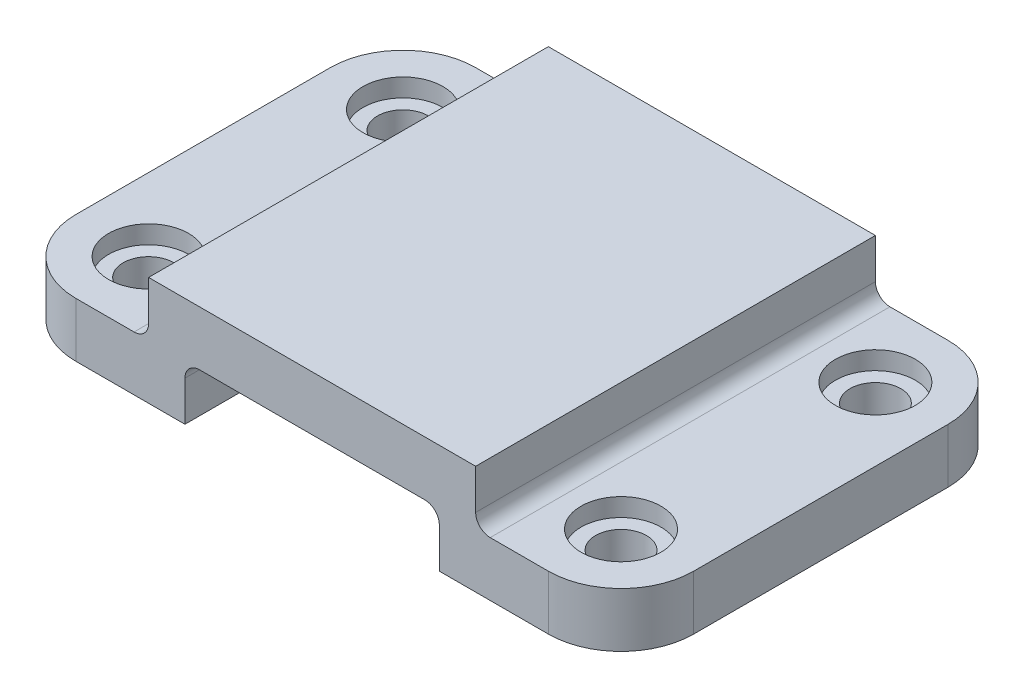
ISO-10303-21;
HEADER;
FILE_DESCRIPTION(('STEP AP214'),'2;1');
FILE_NAME('part.step','',(''),(''),'','','');
FILE_SCHEMA(('AUTOMOTIVE_DESIGN { 1 0 10303 214 1 1 1 1 }'));
ENDSEC;
DATA;
#1=APPLICATION_CONTEXT('core data for automotive mechanical design processes');
#2=APPLICATION_PROTOCOL_DEFINITION('international standard','automotive_design',2000,#1);
#3=PRODUCT_CONTEXT('',#1,'mechanical');
#4=PRODUCT('Part','Part','',(#3));
#5=PRODUCT_RELATED_PRODUCT_CATEGORY('part','',(#4));
#6=PRODUCT_DEFINITION_FORMATION('','',#4);
#7=PRODUCT_DEFINITION_CONTEXT('part definition',#1,'design');
#8=PRODUCT_DEFINITION('design','',#6,#7);
#9=PRODUCT_DEFINITION_SHAPE('','',#8);
#10=(LENGTH_UNIT() NAMED_UNIT(*) SI_UNIT(.MILLI.,.METRE.));
#11=(NAMED_UNIT(*) PLANE_ANGLE_UNIT() SI_UNIT($,.RADIAN.));
#12=(NAMED_UNIT(*) SI_UNIT($,.STERADIAN.) SOLID_ANGLE_UNIT());
#13=UNCERTAINTY_MEASURE_WITH_UNIT(LENGTH_MEASURE(1.E-05),#10,'distance_accuracy_value','');
#14=(GEOMETRIC_REPRESENTATION_CONTEXT(3) GLOBAL_UNCERTAINTY_ASSIGNED_CONTEXT((#13)) GLOBAL_UNIT_ASSIGNED_CONTEXT((#10,
#11,#12)) REPRESENTATION_CONTEXT('',''));
#15=CARTESIAN_POINT('',(0.,0.,0.));
#16=DIRECTION('',(0.,0.,1.));
#17=DIRECTION('',(1.,0.,0.));
#18=AXIS2_PLACEMENT_3D('',#15,#16,#17);
#19=CARTESIAN_POINT('',(82.55,-28.5750000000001,25.4));
#20=DIRECTION('',(0.,1.,0.));
#21=DIRECTION('',(-1.,0.,0.));
#22=AXIS2_PLACEMENT_3D('',#19,#20,#21);
#23=CYLINDRICAL_SURFACE('',#22,8.88999999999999);
#24=CARTESIAN_POINT('',(82.55,-28.5750000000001,25.4));
#25=DIRECTION('',(0.,1.,0.));
#26=DIRECTION('',(-1.,0.,0.));
#27=AXIS2_PLACEMENT_3D('',#24,#25,#26);
#28=CIRCLE('',#27,8.88999999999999);
#29=CARTESIAN_POINT('',(73.66,-28.5750000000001,25.4));
#30=VERTEX_POINT('',#29);
#31=EDGE_CURVE('E322',#30,#30,#28,.T.);
#32=CARTESIAN_POINT('',(82.55,-15.8750000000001,25.4));
#33=DIRECTION('',(0.,1.,0.));
#34=DIRECTION('',(-1.,0.,0.));
#35=AXIS2_PLACEMENT_3D('',#32,#33,#34);
#36=CIRCLE('',#35,8.88999999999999);
#37=CARTESIAN_POINT('',(73.66,-15.8750000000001,25.4));
#38=VERTEX_POINT('',#37);
#39=EDGE_CURVE('E321',#38,#38,#36,.F.);
#40=CARTESIAN_POINT('',(73.66,-28.5750000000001,25.4));
#41=CARTESIAN_POINT('',(73.66,-28.4427083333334,25.4));
#42=CARTESIAN_POINT('',(73.66,-28.3104166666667,25.4));
#43=CARTESIAN_POINT('',(73.66,-28.0458333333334,25.4));
#44=CARTESIAN_POINT('',(73.66,-27.9135416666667,25.4));
#45=CARTESIAN_POINT('',(73.66,-27.6489583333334,25.4));
#46=CARTESIAN_POINT('',(73.66,-27.5166666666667,25.4));
#47=CARTESIAN_POINT('',(73.66,-27.2520833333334,25.4));
#48=CARTESIAN_POINT('',(73.66,-27.1197916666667,25.4));
#49=CARTESIAN_POINT('',(73.66,-26.8552083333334,25.4));
#50=CARTESIAN_POINT('',(73.66,-26.7229166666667,25.4));
#51=CARTESIAN_POINT('',(73.66,-26.4583333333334,25.4));
#52=CARTESIAN_POINT('',(73.66,-26.3260416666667,25.4));
#53=CARTESIAN_POINT('',(73.66,-26.0614583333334,25.4));
#54=CARTESIAN_POINT('',(73.66,-25.9291666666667,25.4));
#55=CARTESIAN_POINT('',(73.66,-25.6645833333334,25.4));
#56=CARTESIAN_POINT('',(73.66,-25.5322916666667,25.4));
#57=CARTESIAN_POINT('',(73.66,-25.2677083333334,25.4));
#58=CARTESIAN_POINT('',(73.66,-25.1354166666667,25.4));
#59=CARTESIAN_POINT('',(73.66,-24.8708333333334,25.4));
#60=CARTESIAN_POINT('',(73.66,-24.7385416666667,25.4));
#61=CARTESIAN_POINT('',(73.66,-24.4739583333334,25.4));
#62=CARTESIAN_POINT('',(73.66,-24.3416666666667,25.4));
#63=CARTESIAN_POINT('',(73.66,-24.0770833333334,25.4));
#64=CARTESIAN_POINT('',(73.66,-23.9447916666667,25.4));
#65=CARTESIAN_POINT('',(73.66,-23.6802083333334,25.4));
#66=CARTESIAN_POINT('',(73.66,-23.5479166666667,25.4));
#67=CARTESIAN_POINT('',(73.66,-23.2833333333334,25.4));
#68=CARTESIAN_POINT('',(73.66,-23.1510416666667,25.4));
#69=CARTESIAN_POINT('',(73.66,-22.8864583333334,25.4));
#70=CARTESIAN_POINT('',(73.66,-22.7541666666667,25.4));
#71=CARTESIAN_POINT('',(73.66,-22.4895833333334,25.4));
#72=CARTESIAN_POINT('',(73.66,-22.3572916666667,25.4));
#73=CARTESIAN_POINT('',(73.66,-22.0927083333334,25.4));
#74=CARTESIAN_POINT('',(73.66,-21.9604166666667,25.4));
#75=CARTESIAN_POINT('',(73.66,-21.6958333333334,25.4));
#76=CARTESIAN_POINT('',(73.66,-21.5635416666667,25.4));
#77=CARTESIAN_POINT('',(73.66,-21.2989583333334,25.4));
#78=CARTESIAN_POINT('',(73.66,-21.1666666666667,25.4));
#79=CARTESIAN_POINT('',(73.66,-20.9020833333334,25.4));
#80=CARTESIAN_POINT('',(73.66,-20.7697916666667,25.4));
#81=CARTESIAN_POINT('',(73.66,-20.5052083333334,25.4));
#82=CARTESIAN_POINT('',(73.66,-20.3729166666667,25.4));
#83=CARTESIAN_POINT('',(73.66,-20.1083333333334,25.4));
#84=CARTESIAN_POINT('',(73.66,-19.9760416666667,25.4));
#85=CARTESIAN_POINT('',(73.66,-19.7114583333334,25.4));
#86=CARTESIAN_POINT('',(73.66,-19.5791666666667,25.4));
#87=CARTESIAN_POINT('',(73.66,-19.3145833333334,25.4));
#88=CARTESIAN_POINT('',(73.66,-19.1822916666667,25.4));
#89=CARTESIAN_POINT('',(73.66,-18.9177083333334,25.4));
#90=CARTESIAN_POINT('',(73.66,-18.7854166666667,25.4));
#91=CARTESIAN_POINT('',(73.66,-18.5208333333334,25.4));
#92=CARTESIAN_POINT('',(73.66,-18.3885416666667,25.4));
#93=CARTESIAN_POINT('',(73.66,-18.1239583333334,25.4));
#94=CARTESIAN_POINT('',(73.66,-17.9916666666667,25.4));
#95=CARTESIAN_POINT('',(73.66,-17.7270833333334,25.4));
#96=CARTESIAN_POINT('',(73.66,-17.5947916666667,25.4));
#97=CARTESIAN_POINT('',(73.66,-17.3302083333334,25.4));
#98=CARTESIAN_POINT('',(73.66,-17.1979166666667,25.4));
#99=CARTESIAN_POINT('',(73.66,-16.9333333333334,25.4));
#100=CARTESIAN_POINT('',(73.66,-16.8010416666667,25.4));
#101=CARTESIAN_POINT('',(73.66,-16.5364583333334,25.4));
#102=CARTESIAN_POINT('',(73.66,-16.4041666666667,25.4));
#103=CARTESIAN_POINT('',(73.66,-16.1395833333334,25.4));
#104=CARTESIAN_POINT('',(73.66,-16.0072916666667,25.4));
#105=CARTESIAN_POINT('',(73.66,-15.8750000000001,25.4));
#106=B_SPLINE_CURVE_WITH_KNOTS('',3,(#40,#41,#42,#43,#44,#45,#46,#47,#48,#49,#50,#51,#52,#53,
#54,#55,#56,#57,#58,#59,#60,#61,#62,#63,#64,#65,#66,#67,#68,#69,#70,#71,#72,#73,#74,#75,#76,#77,
#78,#79,#80,#81,#82,#83,#84,#85,#86,#87,#88,#89,#90,#91,#92,#93,#94,#95,#96,#97,#98,#99,#100,
#101,#102,#103,#104,#105),.UNSPECIFIED.,.F.,.F.,(4,2,2,2,2,2,2,2,2,2,2,2,2,2,2,2,2,2,2,2,2,2,2,
2,2,2,2,2,2,2,2,2,4),(0.,0.396874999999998,0.793749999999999,1.190625,1.5875,1.984375,2.38125,
2.778125,3.175,3.571875,3.96875,4.365625,4.7625,5.159375,5.55625,5.953125,6.35,6.746875,7.14375,
7.540625,7.9375,8.334375,8.73125,9.128125,9.525,9.921875,10.31875,10.715625,11.1125,11.509375,
11.90625,12.303125,12.7),.UNSPECIFIED.);
#107=EDGE_CURVE('BSEAM24',#30,#38,#106,.T.);
#108=ORIENTED_EDGE('',*,*,#31,.F.);
#109=ORIENTED_EDGE('',*,*,#39,.F.);
#110=ORIENTED_EDGE('',*,*,#107,.T.);
#111=ORIENTED_EDGE('',*,*,#107,.F.);
#112=EDGE_LOOP('',(#108,#110,#109,#111));
#113=FACE_BOUND('',#112,.T.);
#114=ADVANCED_FACE('F24',(#113),#23,.F.);
#115=CARTESIAN_POINT('',(57.15,9.525,69.85));
#116=DIRECTION('',(0.,-1.,0.));
#117=DIRECTION('',(1.,0.,0.));
#118=AXIS2_PLACEMENT_3D('',#115,#116,#117);
#119=PLANE('',#118);
#120=DIRECTION('',(-1.,0.,0.));
#121=VECTOR('',#120,1.);
#122=CARTESIAN_POINT('',(57.15,9.525,0.));
#123=LINE('',#122,#121);
#124=CARTESIAN_POINT('',(57.15,9.525,0.));
#125=VERTEX_POINT('',#124);
#126=CARTESIAN_POINT('',(-57.15,9.525,0.));
#127=VERTEX_POINT('',#126);
#128=EDGE_CURVE('E325',#125,#127,#123,.T.);
#129=ORIENTED_EDGE('',*,*,#128,.T.);
#130=DIRECTION('',(0.,0.,-1.));
#131=VECTOR('',#130,1.);
#132=CARTESIAN_POINT('',(-57.15,9.525,69.85));
#133=LINE('',#132,#131);
#134=CARTESIAN_POINT('',(-57.15,9.525,139.7));
#135=VERTEX_POINT('',#134);
#136=EDGE_CURVE('E282',#135,#127,#133,.T.);
#137=ORIENTED_EDGE('',*,*,#136,.F.);
#138=DIRECTION('',(-1.,0.,0.));
#139=VECTOR('',#138,1.);
#140=CARTESIAN_POINT('',(57.15,9.525,139.7));
#141=LINE('',#140,#139);
#142=CARTESIAN_POINT('',(57.15,9.525,139.7));
#143=VERTEX_POINT('',#142);
#144=EDGE_CURVE('E227',#143,#135,#141,.T.);
#145=ORIENTED_EDGE('',*,*,#144,.F.);
#146=DIRECTION('',(0.,0.,-1.));
#147=VECTOR('',#146,1.);
#148=CARTESIAN_POINT('',(57.15,9.525,69.85));
#149=LINE('',#148,#147);
#150=EDGE_CURVE('E339',#143,#125,#149,.T.);
#151=ORIENTED_EDGE('',*,*,#150,.T.);
#152=EDGE_LOOP('',(#129,#137,#145,#151));
#153=FACE_BOUND('',#152,.T.);
#154=ADVANCED_FACE('F26',(#153),#119,.F.);
#155=CARTESIAN_POINT('',(0.,-9.525,69.85));
#156=DIRECTION('',(0.,1.,0.));
#157=DIRECTION('',(0.,0.,1.));
#158=AXIS2_PLACEMENT_3D('',#155,#156,#157);
#159=PLANE('',#158);
#160=DIRECTION('',(1.,0.,0.));
#161=VECTOR('',#160,1.);
#162=CARTESIAN_POINT('',(0.,-9.525,0.));
#163=LINE('',#162,#161);
#164=CARTESIAN_POINT('',(-39.37,-9.525,0.));
#165=VERTEX_POINT('',#164);
#166=CARTESIAN_POINT('',(39.37,-9.525,0.));
#167=VERTEX_POINT('',#166);
#168=EDGE_CURVE('E327',#165,#167,#163,.T.);
#169=ORIENTED_EDGE('',*,*,#168,.T.);
#170=DIRECTION('',(0.,0.,-1.));
#171=VECTOR('',#170,1.);
#172=CARTESIAN_POINT('',(39.37,-9.525,69.85));
#173=LINE('',#172,#171);
#174=CARTESIAN_POINT('',(39.37,-9.525,139.7));
#175=VERTEX_POINT('',#174);
#176=EDGE_CURVE('E365',#167,#175,#173,.F.);
#177=ORIENTED_EDGE('',*,*,#176,.T.);
#178=DIRECTION('',(1.,0.,0.));
#179=VECTOR('',#178,1.);
#180=CARTESIAN_POINT('',(0.,-9.525,139.7));
#181=LINE('',#180,#179);
#182=CARTESIAN_POINT('',(-39.37,-9.525,139.7));
#183=VERTEX_POINT('',#182);
#184=EDGE_CURVE('E230',#183,#175,#181,.T.);
#185=ORIENTED_EDGE('',*,*,#184,.F.);
#186=DIRECTION('',(0.,0.,-1.));
#187=VECTOR('',#186,1.);
#188=CARTESIAN_POINT('',(-39.37,-9.525,69.85));
#189=LINE('',#188,#187);
#190=EDGE_CURVE('E303',#165,#183,#189,.F.);
#191=ORIENTED_EDGE('',*,*,#190,.F.);
#192=EDGE_LOOP('',(#169,#177,#185,#191));
#193=FACE_BOUND('',#192,.T.);
#194=ADVANCED_FACE('F377',(#193),#159,.F.);
#195=CARTESIAN_POINT('',(44.45,-9.525,69.85));
#196=DIRECTION('',(1.,0.,0.));
#197=DIRECTION('',(0.,1.,0.));
#198=AXIS2_PLACEMENT_3D('',#195,#196,#197);
#199=PLANE('',#198);
#200=DIRECTION('',(0.,0.,-1.));
#201=VECTOR('',#200,1.);
#202=CARTESIAN_POINT('',(44.45,-28.5750000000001,69.85));
#203=LINE('',#202,#201);
#204=CARTESIAN_POINT('',(44.45,-28.5750000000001,139.7));
#205=VERTEX_POINT('',#204);
#206=CARTESIAN_POINT('',(44.45,-28.5750000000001,0.));
#207=VERTEX_POINT('',#206);
#208=EDGE_CURVE('E348',#205,#207,#203,.T.);
#209=ORIENTED_EDGE('',*,*,#208,.F.);
#210=DIRECTION('',(0.,-1.,0.));
#211=VECTOR('',#210,1.);
#212=CARTESIAN_POINT('',(44.45,-9.525,139.7));
#213=LINE('',#212,#211);
#214=CARTESIAN_POINT('',(44.45,-14.605,139.7));
#215=VERTEX_POINT('',#214);
#216=EDGE_CURVE('E233',#215,#205,#213,.T.);
#217=ORIENTED_EDGE('',*,*,#216,.F.);
#218=DIRECTION('',(0.,0.,-1.));
#219=VECTOR('',#218,1.);
#220=CARTESIAN_POINT('',(44.45,-14.605,0.));
#221=LINE('',#220,#219);
#222=CARTESIAN_POINT('',(44.45,-14.605,0.));
#223=VERTEX_POINT('',#222);
#224=EDGE_CURVE('E360',#215,#223,#221,.T.);
#225=ORIENTED_EDGE('',*,*,#224,.T.);
#226=DIRECTION('',(0.,-1.,0.));
#227=VECTOR('',#226,1.);
#228=CARTESIAN_POINT('',(44.45,-9.525,0.));
#229=LINE('',#228,#227);
#230=EDGE_CURVE('E330',#223,#207,#229,.T.);
#231=ORIENTED_EDGE('',*,*,#230,.T.);
#232=EDGE_LOOP('',(#209,#217,#225,#231));
#233=FACE_BOUND('',#232,.T.);
#234=ADVANCED_FACE('F427',(#233),#199,.F.);
#235=CARTESIAN_POINT('',(44.45,-28.5750000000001,69.85));
#236=DIRECTION('',(0.,1.,0.));
#237=DIRECTION('',(0.,0.,1.));
#238=AXIS2_PLACEMENT_3D('',#235,#236,#237);
#239=PLANE('',#238);
#240=ORIENTED_EDGE('',*,*,#31,.T.);
#241=EDGE_LOOP('',(#240));
#242=FACE_BOUND('',#241,.T.);
#243=DIRECTION('',(1.,0.,0.));
#244=VECTOR('',#243,1.);
#245=CARTESIAN_POINT('',(44.45,-28.5750000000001,0.));
#246=LINE('',#245,#244);
#247=CARTESIAN_POINT('',(82.55,-28.5750000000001,0.));
#248=VERTEX_POINT('',#247);
#249=EDGE_CURVE('E332',#207,#248,#246,.T.);
#250=ORIENTED_EDGE('',*,*,#249,.T.);
#251=CARTESIAN_POINT('',(82.55,-28.5750000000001,25.4));
#252=DIRECTION('',(0.,1.,0.));
#253=DIRECTION('',(0.,0.,1.));
#254=AXIS2_PLACEMENT_3D('',#251,#252,#253);
#255=CIRCLE('',#254,25.4);
#256=CARTESIAN_POINT('',(107.95,-28.5750000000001,25.4));
#257=VERTEX_POINT('',#256);
#258=EDGE_CURVE('E358',#248,#257,#255,.F.);
#259=ORIENTED_EDGE('',*,*,#258,.T.);
#260=DIRECTION('',(0.,0.,-1.));
#261=VECTOR('',#260,1.);
#262=CARTESIAN_POINT('',(107.95,-28.5750000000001,69.85));
#263=LINE('',#262,#261);
#264=CARTESIAN_POINT('',(107.95,-28.5750000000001,114.3));
#265=VERTEX_POINT('',#264);
#266=EDGE_CURVE('E345',#265,#257,#263,.T.);
#267=ORIENTED_EDGE('',*,*,#266,.F.);
#268=CARTESIAN_POINT('',(82.55,-28.5750000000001,114.3));
#269=DIRECTION('',(0.,-1.,0.));
#270=DIRECTION('',(0.,0.,-1.));
#271=AXIS2_PLACEMENT_3D('',#268,#269,#270);
#272=CIRCLE('',#271,25.4);
#273=CARTESIAN_POINT('',(82.55,-28.5750000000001,139.7));
#274=VERTEX_POINT('',#273);
#275=EDGE_CURVE('E252',#274,#265,#272,.F.);
#276=ORIENTED_EDGE('',*,*,#275,.F.);
#277=DIRECTION('',(1.,0.,0.));
#278=VECTOR('',#277,1.);
#279=CARTESIAN_POINT('',(44.45,-28.5750000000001,139.7));
#280=LINE('',#279,#278);
#281=EDGE_CURVE('E236',#205,#274,#280,.T.);
#282=ORIENTED_EDGE('',*,*,#281,.F.);
#283=ORIENTED_EDGE('',*,*,#208,.T.);
#284=EDGE_LOOP('',(#250,#259,#267,#276,#282,#283));
#285=FACE_BOUND('',#284,.T.);
#286=CARTESIAN_POINT('',(82.55,-28.5750000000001,114.3));
#287=DIRECTION('',(0.,-1.,0.));
#288=DIRECTION('',(-1.,0.,0.));
#289=AXIS2_PLACEMENT_3D('',#286,#287,#288);
#290=CIRCLE('',#289,8.88999999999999);
#291=CARTESIAN_POINT('',(73.66,-28.5750000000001,114.3));
#292=VERTEX_POINT('',#291);
#293=EDGE_CURVE('E224',#292,#292,#290,.T.);
#294=ORIENTED_EDGE('',*,*,#293,.F.);
#295=EDGE_LOOP('',(#294));
#296=FACE_BOUND('',#295,.T.);
#297=ADVANCED_FACE('F417',(#242,#285,#296),#239,.F.);
#298=CARTESIAN_POINT('',(107.95,-28.5750000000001,69.85));
#299=DIRECTION('',(-1.,0.,0.));
#300=DIRECTION('',(0.,-1.,0.));
#301=AXIS2_PLACEMENT_3D('',#298,#299,#300);
#302=PLANE('',#301);
#303=ORIENTED_EDGE('',*,*,#266,.T.);
#304=DIRECTION('',(0.,1.,0.));
#305=VECTOR('',#304,1.);
#306=CARTESIAN_POINT('',(107.95,-28.5750000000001,25.4));
#307=LINE('',#306,#305);
#308=CARTESIAN_POINT('',(107.95,-9.52500000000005,25.4));
#309=VERTEX_POINT('',#308);
#310=EDGE_CURVE('E351',#257,#309,#307,.T.);
#311=ORIENTED_EDGE('',*,*,#310,.T.);
#312=DIRECTION('',(0.,0.,-1.));
#313=VECTOR('',#312,1.);
#314=CARTESIAN_POINT('',(107.95,-9.52500000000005,69.85));
#315=LINE('',#314,#313);
#316=CARTESIAN_POINT('',(107.95,-9.52500000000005,114.3));
#317=VERTEX_POINT('',#316);
#318=EDGE_CURVE('E342',#317,#309,#315,.T.);
#319=ORIENTED_EDGE('',*,*,#318,.F.);
#320=DIRECTION('',(0.,1.,0.));
#321=VECTOR('',#320,1.);
#322=CARTESIAN_POINT('',(107.95,-28.5750000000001,114.3));
#323=LINE('',#322,#321);
#324=EDGE_CURVE('E244',#265,#317,#323,.T.);
#325=ORIENTED_EDGE('',*,*,#324,.F.);
#326=EDGE_LOOP('',(#303,#311,#319,#325));
#327=FACE_BOUND('',#326,.T.);
#328=ADVANCED_FACE('F422',(#327),#302,.F.);
#329=CARTESIAN_POINT('',(107.95,-9.52500000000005,69.85));
#330=DIRECTION('',(0.,-1.,0.));
#331=DIRECTION('',(1.,0.,0.));
#332=AXIS2_PLACEMENT_3D('',#329,#330,#331);
#333=PLANE('',#332);
#334=CARTESIAN_POINT('',(82.55,-9.52500000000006,25.4));
#335=DIRECTION('',(0.,1.,0.));
#336=DIRECTION('',(-1.,0.,0.));
#337=AXIS2_PLACEMENT_3D('',#334,#335,#336);
#338=CIRCLE('',#337,13.97);
#339=CARTESIAN_POINT('',(68.58,-9.52500000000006,25.4));
#340=VERTEX_POINT('',#339);
#341=EDGE_CURVE('E315',#340,#340,#338,.T.);
#342=ORIENTED_EDGE('',*,*,#341,.F.);
#343=EDGE_LOOP('',(#342));
#344=FACE_BOUND('',#343,.T.);
#345=DIRECTION('',(-1.,0.,0.));
#346=VECTOR('',#345,1.);
#347=CARTESIAN_POINT('',(107.95,-9.52500000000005,0.));
#348=LINE('',#347,#346);
#349=CARTESIAN_POINT('',(82.55,-9.52500000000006,0.));
#350=VERTEX_POINT('',#349);
#351=CARTESIAN_POINT('',(62.23,-9.52500000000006,0.));
#352=VERTEX_POINT('',#351);
#353=EDGE_CURVE('E335',#350,#352,#348,.T.);
#354=ORIENTED_EDGE('',*,*,#353,.T.);
#355=DIRECTION('',(0.,0.,-1.));
#356=VECTOR('',#355,1.);
#357=CARTESIAN_POINT('',(62.23,-9.52500000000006,69.85));
#358=LINE('',#357,#356);
#359=CARTESIAN_POINT('',(62.23,-9.52500000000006,139.7));
#360=VERTEX_POINT('',#359);
#361=EDGE_CURVE('E369',#352,#360,#358,.F.);
#362=ORIENTED_EDGE('',*,*,#361,.T.);
#363=DIRECTION('',(-1.,0.,0.));
#364=VECTOR('',#363,1.);
#365=CARTESIAN_POINT('',(107.95,-9.52500000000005,139.7));
#366=LINE('',#365,#364);
#367=CARTESIAN_POINT('',(82.55,-9.52500000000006,139.7));
#368=VERTEX_POINT('',#367);
#369=EDGE_CURVE('E239',#368,#360,#366,.T.);
#370=ORIENTED_EDGE('',*,*,#369,.F.);
#371=CARTESIAN_POINT('',(82.55,-9.52500000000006,114.3));
#372=DIRECTION('',(0.,1.,0.));
#373=DIRECTION('',(1.,0.,0.));
#374=AXIS2_PLACEMENT_3D('',#371,#372,#373);
#375=CIRCLE('',#374,25.4);
#376=EDGE_CURVE('E247',#317,#368,#375,.F.);
#377=ORIENTED_EDGE('',*,*,#376,.F.);
#378=ORIENTED_EDGE('',*,*,#318,.T.);
#379=CARTESIAN_POINT('',(82.55,-9.52500000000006,25.4));
#380=DIRECTION('',(0.,-1.,0.));
#381=DIRECTION('',(1.,0.,0.));
#382=AXIS2_PLACEMENT_3D('',#379,#380,#381);
#383=CIRCLE('',#382,25.4);
#384=EDGE_CURVE('E354',#309,#350,#383,.F.);
#385=ORIENTED_EDGE('',*,*,#384,.T.);
#386=EDGE_LOOP('',(#354,#362,#370,#377,#378,#385));
#387=FACE_BOUND('',#386,.T.);
#388=CARTESIAN_POINT('',(82.55,-9.52500000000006,114.3));
#389=DIRECTION('',(0.,-1.,0.));
#390=DIRECTION('',(-1.,0.,0.));
#391=AXIS2_PLACEMENT_3D('',#388,#389,#390);
#392=CIRCLE('',#391,13.97);
#393=CARTESIAN_POINT('',(68.58,-9.52500000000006,114.3));
#394=VERTEX_POINT('',#393);
#395=EDGE_CURVE('E217',#394,#394,#392,.T.);
#396=ORIENTED_EDGE('',*,*,#395,.T.);
#397=EDGE_LOOP('',(#396));
#398=FACE_BOUND('',#397,.T.);
#399=ADVANCED_FACE('F408',(#344,#387,#398),#333,.F.);
#400=CARTESIAN_POINT('',(57.15,-9.52500000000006,69.85));
#401=DIRECTION('',(-1.,0.,0.));
#402=DIRECTION('',(0.,0.,1.));
#403=AXIS2_PLACEMENT_3D('',#400,#401,#402);
#404=PLANE('',#403);
#405=ORIENTED_EDGE('',*,*,#150,.F.);
#406=DIRECTION('',(0.,1.,0.));
#407=VECTOR('',#406,1.);
#408=CARTESIAN_POINT('',(57.15,-9.52500000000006,139.7));
#409=LINE('',#408,#407);
#410=CARTESIAN_POINT('',(57.15,-4.44500000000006,139.7));
#411=VERTEX_POINT('',#410);
#412=EDGE_CURVE('E241',#411,#143,#409,.T.);
#413=ORIENTED_EDGE('',*,*,#412,.F.);
#414=DIRECTION('',(0.,0.,-1.));
#415=VECTOR('',#414,1.);
#416=CARTESIAN_POINT('',(57.15,-4.44500000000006,0.));
#417=LINE('',#416,#415);
#418=CARTESIAN_POINT('',(57.15,-4.44500000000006,0.));
#419=VERTEX_POINT('',#418);
#420=EDGE_CURVE('E367',#411,#419,#417,.T.);
#421=ORIENTED_EDGE('',*,*,#420,.T.);
#422=DIRECTION('',(0.,1.,0.));
#423=VECTOR('',#422,1.);
#424=CARTESIAN_POINT('',(57.15,-9.52500000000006,0.));
#425=LINE('',#424,#423);
#426=EDGE_CURVE('E337',#419,#125,#425,.T.);
#427=ORIENTED_EDGE('',*,*,#426,.T.);
#428=EDGE_LOOP('',(#405,#413,#421,#427));
#429=FACE_BOUND('',#428,.T.);
#430=ADVANCED_FACE('F403',(#429),#404,.F.);
#431=CARTESIAN_POINT('',(0.,9.525,0.));
#432=DIRECTION('',(0.,0.,1.));
#433=DIRECTION('',(1.,0.,0.));
#434=AXIS2_PLACEMENT_3D('',#431,#432,#433);
#435=PLANE('',#434);
#436=ORIENTED_EDGE('',*,*,#353,.F.);
#437=DIRECTION('',(0.,1.,0.));
#438=VECTOR('',#437,1.);
#439=CARTESIAN_POINT('',(82.55,9.52499999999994,0.));
#440=LINE('',#439,#438);
#441=EDGE_CURVE('E356',#350,#248,#440,.F.);
#442=ORIENTED_EDGE('',*,*,#441,.T.);
#443=ORIENTED_EDGE('',*,*,#249,.F.);
#444=ORIENTED_EDGE('',*,*,#230,.F.);
#445=CARTESIAN_POINT('',(39.37,-14.605,0.));
#446=DIRECTION('',(0.,0.,1.));
#447=DIRECTION('',(1.,0.,0.));
#448=AXIS2_PLACEMENT_3D('',#445,#446,#447);
#449=CIRCLE('',#448,5.08);
#450=EDGE_CURVE('E32',#223,#167,#449,.T.);
#451=ORIENTED_EDGE('',*,*,#450,.T.);
#452=ORIENTED_EDGE('',*,*,#168,.F.);
#453=CARTESIAN_POINT('',(-39.37,-14.605,0.));
#454=DIRECTION('',(0.,0.,-1.));
#455=DIRECTION('',(-1.,0.,0.));
#456=AXIS2_PLACEMENT_3D('',#453,#454,#455);
#457=CIRCLE('',#456,5.08);
#458=CARTESIAN_POINT('',(-44.45,-14.605,0.));
#459=VERTEX_POINT('',#458);
#460=EDGE_CURVE('E310',#459,#165,#457,.T.);
#461=ORIENTED_EDGE('',*,*,#460,.F.);
#462=DIRECTION('',(0.,-1.,0.));
#463=VECTOR('',#462,1.);
#464=CARTESIAN_POINT('',(-44.45,-9.525,0.));
#465=LINE('',#464,#463);
#466=CARTESIAN_POINT('',(-44.45,-28.5750000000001,0.));
#467=VERTEX_POINT('',#466);
#468=EDGE_CURVE('E273',#459,#467,#465,.T.);
#469=ORIENTED_EDGE('',*,*,#468,.T.);
#470=DIRECTION('',(-1.,0.,0.));
#471=VECTOR('',#470,1.);
#472=CARTESIAN_POINT('',(-44.45,-28.5750000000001,0.));
#473=LINE('',#472,#471);
#474=CARTESIAN_POINT('',(-82.55,-28.5750000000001,0.));
#475=VERTEX_POINT('',#474);
#476=EDGE_CURVE('E169',#467,#475,#473,.T.);
#477=ORIENTED_EDGE('',*,*,#476,.T.);
#478=DIRECTION('',(0.,1.,0.));
#479=VECTOR('',#478,1.);
#480=CARTESIAN_POINT('',(-82.55,9.52499999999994,0.));
#481=LINE('',#480,#479);
#482=CARTESIAN_POINT('',(-82.55,-9.52500000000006,0.));
#483=VERTEX_POINT('',#482);
#484=EDGE_CURVE('E295',#483,#475,#481,.F.);
#485=ORIENTED_EDGE('',*,*,#484,.F.);
#486=DIRECTION('',(1.,0.,0.));
#487=VECTOR('',#486,1.);
#488=CARTESIAN_POINT('',(-107.95,-9.52500000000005,0.));
#489=LINE('',#488,#487);
#490=CARTESIAN_POINT('',(-62.23,-9.52500000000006,0.));
#491=VERTEX_POINT('',#490);
#492=EDGE_CURVE('E276',#483,#491,#489,.T.);
#493=ORIENTED_EDGE('',*,*,#492,.T.);
#494=CARTESIAN_POINT('',(-62.23,-4.44500000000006,0.));
#495=DIRECTION('',(0.,0.,-1.));
#496=DIRECTION('',(-1.,0.,0.));
#497=AXIS2_PLACEMENT_3D('',#494,#495,#496);
#498=CIRCLE('',#497,5.08);
#499=CARTESIAN_POINT('',(-57.15,-4.44500000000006,0.));
#500=VERTEX_POINT('',#499);
#501=EDGE_CURVE('E313',#500,#491,#498,.T.);
#502=ORIENTED_EDGE('',*,*,#501,.F.);
#503=DIRECTION('',(0.,1.,0.));
#504=VECTOR('',#503,1.);
#505=CARTESIAN_POINT('',(-57.15,-9.52500000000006,0.));
#506=LINE('',#505,#504);
#507=EDGE_CURVE('E279',#500,#127,#506,.T.);
#508=ORIENTED_EDGE('',*,*,#507,.T.);
#509=ORIENTED_EDGE('',*,*,#128,.F.);
#510=ORIENTED_EDGE('',*,*,#426,.F.);
#511=CARTESIAN_POINT('',(62.23,-4.44500000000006,0.));
#512=DIRECTION('',(0.,0.,1.));
#513=DIRECTION('',(1.,0.,0.));
#514=AXIS2_PLACEMENT_3D('',#511,#512,#513);
#515=CIRCLE('',#514,5.08);
#516=EDGE_CURVE('E11',#419,#352,#515,.T.);
#517=ORIENTED_EDGE('',*,*,#516,.T.);
#518=EDGE_LOOP('',(#436,#442,#443,#444,#451,#452,#461,#469,#477,#485,#493,#502,#508,#509,#510,#517));
#519=FACE_BOUND('',#518,.T.);
#520=ADVANCED_FACE('F371',(#519),#435,.F.);
#521=CARTESIAN_POINT('',(82.55,-28.575,25.4));
#522=DIRECTION('',(0.,1.,0.));
#523=DIRECTION('',(-1.,0.,0.));
#524=AXIS2_PLACEMENT_3D('',#521,#522,#523);
#525=CYLINDRICAL_SURFACE('',#524,25.4);
#526=ORIENTED_EDGE('',*,*,#258,.F.);
#527=ORIENTED_EDGE('',*,*,#441,.F.);
#528=ORIENTED_EDGE('',*,*,#384,.F.);
#529=ORIENTED_EDGE('',*,*,#310,.F.);
#530=EDGE_LOOP('',(#526,#527,#528,#529));
#531=FACE_BOUND('',#530,.T.);
#532=ADVANCED_FACE('F414',(#531),#525,.T.);
#533=CARTESIAN_POINT('',(82.55,-15.8750000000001,25.4));
#534=DIRECTION('',(0.,1.,0.));
#535=DIRECTION('',(-1.,0.,0.));
#536=AXIS2_PLACEMENT_3D('',#533,#534,#535);
#537=PLANE('',#536);
#538=CARTESIAN_POINT('',(82.55,-15.8750000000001,25.4));
#539=DIRECTION('',(0.,1.,0.));
#540=DIRECTION('',(-1.,0.,0.));
#541=AXIS2_PLACEMENT_3D('',#538,#539,#540);
#542=CIRCLE('',#541,13.97);
#543=CARTESIAN_POINT('',(68.58,-15.8750000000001,25.4));
#544=VERTEX_POINT('',#543);
#545=EDGE_CURVE('E318',#544,#544,#542,.T.);
#546=ORIENTED_EDGE('',*,*,#545,.T.);
#547=EDGE_LOOP('',(#546));
#548=FACE_BOUND('',#547,.T.);
#549=ORIENTED_EDGE('',*,*,#39,.T.);
#550=EDGE_LOOP('',(#549));
#551=FACE_BOUND('',#550,.T.);
#552=ADVANCED_FACE('F451',(#548,#551),#537,.T.);
#553=CARTESIAN_POINT('',(82.55,-15.8750000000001,25.4));
#554=DIRECTION('',(0.,1.,0.));
#555=DIRECTION('',(-1.,0.,0.));
#556=AXIS2_PLACEMENT_3D('',#553,#554,#555);
#557=CYLINDRICAL_SURFACE('',#556,13.97);
#558=ORIENTED_EDGE('',*,*,#545,.F.);
#559=EDGE_LOOP('',(#558));
#560=FACE_BOUND('',#559,.T.);
#561=ORIENTED_EDGE('',*,*,#341,.T.);
#562=EDGE_LOOP('',(#561));
#563=FACE_BOUND('',#562,.T.);
#564=ADVANCED_FACE('F448',(#560,#563),#557,.F.);
#565=CARTESIAN_POINT('',(39.37,-14.605,69.85));
#566=DIRECTION('',(0.,0.,1.));
#567=DIRECTION('',(1.,0.,0.));
#568=AXIS2_PLACEMENT_3D('',#565,#566,#567);
#569=CYLINDRICAL_SURFACE('',#568,5.08);
#570=ORIENTED_EDGE('',*,*,#224,.F.);
#571=CARTESIAN_POINT('',(39.37,-14.605,139.7));
#572=DIRECTION('',(0.,0.,1.));
#573=DIRECTION('',(1.,0.,0.));
#574=AXIS2_PLACEMENT_3D('',#571,#572,#573);
#575=CIRCLE('',#574,5.08);
#576=EDGE_CURVE('E255',#215,#175,#575,.T.);
#577=ORIENTED_EDGE('',*,*,#576,.T.);
#578=ORIENTED_EDGE('',*,*,#176,.F.);
#579=ORIENTED_EDGE('',*,*,#450,.F.);
#580=EDGE_LOOP('',(#570,#577,#578,#579));
#581=FACE_BOUND('',#580,.T.);
#582=ADVANCED_FACE('F379',(#581),#569,.F.);
#583=CARTESIAN_POINT('',(62.23,-4.44500000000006,69.85));
#584=DIRECTION('',(0.,0.,1.));
#585=DIRECTION('',(1.,0.,0.));
#586=AXIS2_PLACEMENT_3D('',#583,#584,#585);
#587=CYLINDRICAL_SURFACE('',#586,5.08);
#588=ORIENTED_EDGE('',*,*,#420,.F.);
#589=CARTESIAN_POINT('',(62.23,-4.44500000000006,139.7));
#590=DIRECTION('',(0.,0.,1.));
#591=DIRECTION('',(1.,0.,0.));
#592=AXIS2_PLACEMENT_3D('',#589,#590,#591);
#593=CIRCLE('',#592,5.08);
#594=EDGE_CURVE('E260',#411,#360,#593,.T.);
#595=ORIENTED_EDGE('',*,*,#594,.T.);
#596=ORIENTED_EDGE('',*,*,#361,.F.);
#597=ORIENTED_EDGE('',*,*,#516,.F.);
#598=EDGE_LOOP('',(#588,#595,#596,#597));
#599=FACE_BOUND('',#598,.T.);
#600=ADVANCED_FACE('F406',(#599),#587,.F.);
#601=CARTESIAN_POINT('',(-82.55,-28.5750000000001,25.4));
#602=DIRECTION('',(0.,1.,0.));
#603=DIRECTION('',(1.,0.,0.));
#604=AXIS2_PLACEMENT_3D('',#601,#602,#603);
#605=CYLINDRICAL_SURFACE('',#604,8.88999999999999);
#606=CARTESIAN_POINT('',(-82.55,-28.5750000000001,25.4));
#607=DIRECTION('',(0.,-1.,0.));
#608=DIRECTION('',(1.,0.,0.));
#609=AXIS2_PLACEMENT_3D('',#606,#607,#608);
#610=CIRCLE('',#609,8.88999999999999);
#611=CARTESIAN_POINT('',(-73.66,-28.5750000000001,25.4));
#612=VERTEX_POINT('',#611);
#613=EDGE_CURVE('E270',#612,#612,#610,.T.);
#614=CARTESIAN_POINT('',(-82.55,-15.8750000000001,25.4));
#615=DIRECTION('',(0.,-1.,0.));
#616=DIRECTION('',(1.,0.,0.));
#617=AXIS2_PLACEMENT_3D('',#614,#615,#616);
#618=CIRCLE('',#617,8.88999999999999);
#619=CARTESIAN_POINT('',(-73.66,-15.8750000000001,25.4));
#620=VERTEX_POINT('',#619);
#621=EDGE_CURVE('E269',#620,#620,#618,.F.);
#622=CARTESIAN_POINT('',(-73.66,-28.5750000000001,25.4));
#623=CARTESIAN_POINT('',(-73.66,-28.4427083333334,25.4));
#624=CARTESIAN_POINT('',(-73.66,-28.3104166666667,25.4));
#625=CARTESIAN_POINT('',(-73.66,-28.0458333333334,25.4));
#626=CARTESIAN_POINT('',(-73.66,-27.9135416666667,25.4));
#627=CARTESIAN_POINT('',(-73.66,-27.6489583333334,25.4));
#628=CARTESIAN_POINT('',(-73.66,-27.5166666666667,25.4));
#629=CARTESIAN_POINT('',(-73.66,-27.2520833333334,25.4));
#630=CARTESIAN_POINT('',(-73.66,-27.1197916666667,25.4));
#631=CARTESIAN_POINT('',(-73.66,-26.8552083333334,25.4));
#632=CARTESIAN_POINT('',(-73.66,-26.7229166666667,25.4));
#633=CARTESIAN_POINT('',(-73.66,-26.4583333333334,25.4));
#634=CARTESIAN_POINT('',(-73.66,-26.3260416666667,25.4));
#635=CARTESIAN_POINT('',(-73.66,-26.0614583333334,25.4));
#636=CARTESIAN_POINT('',(-73.66,-25.9291666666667,25.4));
#637=CARTESIAN_POINT('',(-73.66,-25.6645833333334,25.4));
#638=CARTESIAN_POINT('',(-73.66,-25.5322916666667,25.4));
#639=CARTESIAN_POINT('',(-73.66,-25.2677083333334,25.4));
#640=CARTESIAN_POINT('',(-73.66,-25.1354166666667,25.4));
#641=CARTESIAN_POINT('',(-73.66,-24.8708333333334,25.4));
#642=CARTESIAN_POINT('',(-73.66,-24.7385416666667,25.4));
#643=CARTESIAN_POINT('',(-73.66,-24.4739583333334,25.4));
#644=CARTESIAN_POINT('',(-73.66,-24.3416666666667,25.4));
#645=CARTESIAN_POINT('',(-73.66,-24.0770833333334,25.4));
#646=CARTESIAN_POINT('',(-73.66,-23.9447916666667,25.4));
#647=CARTESIAN_POINT('',(-73.66,-23.6802083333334,25.4));
#648=CARTESIAN_POINT('',(-73.66,-23.5479166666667,25.4));
#649=CARTESIAN_POINT('',(-73.66,-23.2833333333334,25.4));
#650=CARTESIAN_POINT('',(-73.66,-23.1510416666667,25.4));
#651=CARTESIAN_POINT('',(-73.66,-22.8864583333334,25.4));
#652=CARTESIAN_POINT('',(-73.66,-22.7541666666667,25.4));
#653=CARTESIAN_POINT('',(-73.66,-22.4895833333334,25.4));
#654=CARTESIAN_POINT('',(-73.66,-22.3572916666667,25.4));
#655=CARTESIAN_POINT('',(-73.66,-22.0927083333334,25.4));
#656=CARTESIAN_POINT('',(-73.66,-21.9604166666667,25.4));
#657=CARTESIAN_POINT('',(-73.66,-21.6958333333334,25.4));
#658=CARTESIAN_POINT('',(-73.66,-21.5635416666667,25.4));
#659=CARTESIAN_POINT('',(-73.66,-21.2989583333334,25.4));
#660=CARTESIAN_POINT('',(-73.66,-21.1666666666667,25.4));
#661=CARTESIAN_POINT('',(-73.66,-20.9020833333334,25.4));
#662=CARTESIAN_POINT('',(-73.66,-20.7697916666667,25.4));
#663=CARTESIAN_POINT('',(-73.66,-20.5052083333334,25.4));
#664=CARTESIAN_POINT('',(-73.66,-20.3729166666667,25.4));
#665=CARTESIAN_POINT('',(-73.66,-20.1083333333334,25.4));
#666=CARTESIAN_POINT('',(-73.66,-19.9760416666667,25.4));
#667=CARTESIAN_POINT('',(-73.66,-19.7114583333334,25.4));
#668=CARTESIAN_POINT('',(-73.66,-19.5791666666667,25.4));
#669=CARTESIAN_POINT('',(-73.66,-19.3145833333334,25.4));
#670=CARTESIAN_POINT('',(-73.66,-19.1822916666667,25.4));
#671=CARTESIAN_POINT('',(-73.66,-18.9177083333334,25.4));
#672=CARTESIAN_POINT('',(-73.66,-18.7854166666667,25.4));
#673=CARTESIAN_POINT('',(-73.66,-18.5208333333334,25.4));
#674=CARTESIAN_POINT('',(-73.66,-18.3885416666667,25.4));
#675=CARTESIAN_POINT('',(-73.66,-18.1239583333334,25.4));
#676=CARTESIAN_POINT('',(-73.66,-17.9916666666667,25.4));
#677=CARTESIAN_POINT('',(-73.66,-17.7270833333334,25.4));
#678=CARTESIAN_POINT('',(-73.66,-17.5947916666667,25.4));
#679=CARTESIAN_POINT('',(-73.66,-17.3302083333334,25.4));
#680=CARTESIAN_POINT('',(-73.66,-17.1979166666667,25.4));
#681=CARTESIAN_POINT('',(-73.66,-16.9333333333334,25.4));
#682=CARTESIAN_POINT('',(-73.66,-16.8010416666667,25.4));
#683=CARTESIAN_POINT('',(-73.66,-16.5364583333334,25.4));
#684=CARTESIAN_POINT('',(-73.66,-16.4041666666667,25.4));
#685=CARTESIAN_POINT('',(-73.66,-16.1395833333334,25.4));
#686=CARTESIAN_POINT('',(-73.66,-16.0072916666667,25.4));
#687=CARTESIAN_POINT('',(-73.66,-15.8750000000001,25.4));
#688=B_SPLINE_CURVE_WITH_KNOTS('',3,(#622,#623,#624,#625,#626,#627,#628,#629,#630,#631,#632,
#633,#634,#635,#636,#637,#638,#639,#640,#641,#642,#643,#644,#645,#646,#647,#648,#649,#650,#651,
#652,#653,#654,#655,#656,#657,#658,#659,#660,#661,#662,#663,#664,#665,#666,#667,#668,#669,#670,
#671,#672,#673,#674,#675,#676,#677,#678,#679,#680,#681,#682,#683,#684,#685,#686,#687),
.UNSPECIFIED.,.F.,.F.,(4,2,2,2,2,2,2,2,2,2,2,2,2,2,2,2,2,2,2,2,2,2,2,2,2,2,2,2,2,2,2,2,4),(0.,
0.396874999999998,0.793749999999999,1.190625,1.5875,1.984375,2.38125,2.778125,3.175,3.571875,
3.96875,4.365625,4.7625,5.159375,5.55625,5.953125,6.35,6.746875,7.14375,7.540625,7.9375,
8.334375,8.73125,9.128125,9.525,9.921875,10.31875,10.715625,11.1125,11.509375,11.90625,
12.303125,12.7),.UNSPECIFIED.);
#689=EDGE_CURVE('BSEAM488',#612,#620,#688,.T.);
#690=ORIENTED_EDGE('',*,*,#613,.T.);
#691=ORIENTED_EDGE('',*,*,#621,.T.);
#692=ORIENTED_EDGE('',*,*,#689,.T.);
#693=ORIENTED_EDGE('',*,*,#689,.F.);
#694=EDGE_LOOP('',(#690,#692,#691,#693));
#695=FACE_BOUND('',#694,.T.);
#696=ADVANCED_FACE('F488',(#695),#605,.F.);
#697=CARTESIAN_POINT('',(-44.45,-9.525,69.85));
#698=DIRECTION('',(-1.,0.,0.));
#699=DIRECTION('',(0.,1.,0.));
#700=AXIS2_PLACEMENT_3D('',#697,#698,#699);
#701=PLANE('',#700);
#702=DIRECTION('',(0.,0.,-1.));
#703=VECTOR('',#702,1.);
#704=CARTESIAN_POINT('',(-44.45,-14.605,0.));
#705=LINE('',#704,#703);
#706=CARTESIAN_POINT('',(-44.45,-14.605,139.7));
#707=VERTEX_POINT('',#706);
#708=EDGE_CURVE('E180',#707,#459,#705,.T.);
#709=ORIENTED_EDGE('',*,*,#708,.F.);
#710=DIRECTION('',(0.,-1.,0.));
#711=VECTOR('',#710,1.);
#712=CARTESIAN_POINT('',(-44.45,-9.525,139.7));
#713=LINE('',#712,#711);
#714=CARTESIAN_POINT('',(-44.45,-28.5750000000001,139.7));
#715=VERTEX_POINT('',#714);
#716=EDGE_CURVE('E177',#707,#715,#713,.T.);
#717=ORIENTED_EDGE('',*,*,#716,.T.);
#718=DIRECTION('',(0.,0.,-1.));
#719=VECTOR('',#718,1.);
#720=CARTESIAN_POINT('',(-44.45,-28.5750000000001,69.85));
#721=LINE('',#720,#719);
#722=EDGE_CURVE('E159',#715,#467,#721,.T.);
#723=ORIENTED_EDGE('',*,*,#722,.T.);
#724=ORIENTED_EDGE('',*,*,#468,.F.);
#725=EDGE_LOOP('',(#709,#717,#723,#724));
#726=FACE_BOUND('',#725,.T.);
#727=ADVANCED_FACE('F178',(#726),#701,.F.);
#728=CARTESIAN_POINT('',(-44.45,-28.5750000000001,69.85));
#729=DIRECTION('',(0.,1.,0.));
#730=DIRECTION('',(0.,0.,1.));
#731=AXIS2_PLACEMENT_3D('',#728,#729,#730);
#732=PLANE('',#731);
#733=ORIENTED_EDGE('',*,*,#613,.F.);
#734=EDGE_LOOP('',(#733));
#735=FACE_BOUND('',#734,.T.);
#736=ORIENTED_EDGE('',*,*,#476,.F.);
#737=ORIENTED_EDGE('',*,*,#722,.F.);
#738=DIRECTION('',(-1.,0.,0.));
#739=VECTOR('',#738,1.);
#740=CARTESIAN_POINT('',(-44.45,-28.5750000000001,139.7));
#741=LINE('',#740,#739);
#742=CARTESIAN_POINT('',(-82.55,-28.5750000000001,139.7));
#743=VERTEX_POINT('',#742);
#744=EDGE_CURVE('E165',#715,#743,#741,.T.);
#745=ORIENTED_EDGE('',*,*,#744,.T.);
#746=CARTESIAN_POINT('',(-82.55,-28.5750000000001,114.3));
#747=DIRECTION('',(0.,1.,0.));
#748=DIRECTION('',(0.,0.,-1.));
#749=AXIS2_PLACEMENT_3D('',#746,#747,#748);
#750=CIRCLE('',#749,25.4);
#751=CARTESIAN_POINT('',(-107.95,-28.5750000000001,114.3));
#752=VERTEX_POINT('',#751);
#753=EDGE_CURVE('E206',#743,#752,#750,.F.);
#754=ORIENTED_EDGE('',*,*,#753,.T.);
#755=DIRECTION('',(0.,0.,-1.));
#756=VECTOR('',#755,1.);
#757=CARTESIAN_POINT('',(-107.95,-28.5750000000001,69.85));
#758=LINE('',#757,#756);
#759=CARTESIAN_POINT('',(-107.95,-28.5750000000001,25.4));
#760=VERTEX_POINT('',#759);
#761=EDGE_CURVE('E174',#752,#760,#758,.T.);
#762=ORIENTED_EDGE('',*,*,#761,.T.);
#763=CARTESIAN_POINT('',(-82.55,-28.5750000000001,25.4));
#764=DIRECTION('',(0.,-1.,0.));
#765=DIRECTION('',(0.,0.,1.));
#766=AXIS2_PLACEMENT_3D('',#763,#764,#765);
#767=CIRCLE('',#766,25.4);
#768=EDGE_CURVE('E297',#475,#760,#767,.F.);
#769=ORIENTED_EDGE('',*,*,#768,.F.);
#770=EDGE_LOOP('',(#736,#737,#745,#754,#762,#769));
#771=FACE_BOUND('',#770,.T.);
#772=CARTESIAN_POINT('',(-82.55,-28.5750000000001,114.3));
#773=DIRECTION('',(0.,1.,0.));
#774=DIRECTION('',(1.,0.,0.));
#775=AXIS2_PLACEMENT_3D('',#772,#773,#774);
#776=CIRCLE('',#775,8.88999999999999);
#777=CARTESIAN_POINT('',(-73.66,-28.5750000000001,114.3));
#778=VERTEX_POINT('',#777);
#779=EDGE_CURVE('E184',#778,#778,#776,.T.);
#780=ORIENTED_EDGE('',*,*,#779,.T.);
#781=EDGE_LOOP('',(#780));
#782=FACE_BOUND('',#781,.T.);
#783=ADVANCED_FACE('F161',(#735,#771,#782),#732,.F.);
#784=CARTESIAN_POINT('',(-107.95,-28.5750000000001,69.85));
#785=DIRECTION('',(1.,0.,0.));
#786=DIRECTION('',(0.,-1.,0.));
#787=AXIS2_PLACEMENT_3D('',#784,#785,#786);
#788=PLANE('',#787);
#789=ORIENTED_EDGE('',*,*,#761,.F.);
#790=DIRECTION('',(0.,1.,0.));
#791=VECTOR('',#790,1.);
#792=CARTESIAN_POINT('',(-107.95,-28.5750000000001,114.3));
#793=LINE('',#792,#791);
#794=CARTESIAN_POINT('',(-107.95,-9.52500000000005,114.3));
#795=VERTEX_POINT('',#794);
#796=EDGE_CURVE('E200',#752,#795,#793,.T.);
#797=ORIENTED_EDGE('',*,*,#796,.T.);
#798=DIRECTION('',(0.,0.,-1.));
#799=VECTOR('',#798,1.);
#800=CARTESIAN_POINT('',(-107.95,-9.52500000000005,69.85));
#801=LINE('',#800,#799);
#802=CARTESIAN_POINT('',(-107.95,-9.52500000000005,25.4));
#803=VERTEX_POINT('',#802);
#804=EDGE_CURVE('E285',#795,#803,#801,.T.);
#805=ORIENTED_EDGE('',*,*,#804,.T.);
#806=DIRECTION('',(0.,1.,0.));
#807=VECTOR('',#806,1.);
#808=CARTESIAN_POINT('',(-107.95,-28.5750000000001,25.4));
#809=LINE('',#808,#807);
#810=EDGE_CURVE('E173',#760,#803,#809,.T.);
#811=ORIENTED_EDGE('',*,*,#810,.F.);
#812=EDGE_LOOP('',(#789,#797,#805,#811));
#813=FACE_BOUND('',#812,.T.);
#814=ADVANCED_FACE('F503',(#813),#788,.F.);
#815=CARTESIAN_POINT('',(-107.95,-9.52500000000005,69.85));
#816=DIRECTION('',(0.,-1.,0.));
#817=DIRECTION('',(-1.,0.,0.));
#818=AXIS2_PLACEMENT_3D('',#815,#816,#817);
#819=PLANE('',#818);
#820=CARTESIAN_POINT('',(-82.55,-9.52500000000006,25.4));
#821=DIRECTION('',(0.,-1.,0.));
#822=DIRECTION('',(1.,0.,0.));
#823=AXIS2_PLACEMENT_3D('',#820,#821,#822);
#824=CIRCLE('',#823,13.97);
#825=CARTESIAN_POINT('',(-68.58,-9.52500000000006,25.4));
#826=VERTEX_POINT('',#825);
#827=EDGE_CURVE('E263',#826,#826,#824,.T.);
#828=ORIENTED_EDGE('',*,*,#827,.T.);
#829=EDGE_LOOP('',(#828));
#830=FACE_BOUND('',#829,.T.);
#831=ORIENTED_EDGE('',*,*,#492,.F.);
#832=CARTESIAN_POINT('',(-82.55,-9.52500000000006,25.4));
#833=DIRECTION('',(0.,1.,0.));
#834=DIRECTION('',(-1.,0.,0.));
#835=AXIS2_PLACEMENT_3D('',#832,#833,#834);
#836=CIRCLE('',#835,25.4);
#837=EDGE_CURVE('E292',#803,#483,#836,.F.);
#838=ORIENTED_EDGE('',*,*,#837,.F.);
#839=ORIENTED_EDGE('',*,*,#804,.F.);
#840=CARTESIAN_POINT('',(-82.55,-9.52500000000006,114.3));
#841=DIRECTION('',(0.,-1.,0.));
#842=DIRECTION('',(-1.,0.,0.));
#843=AXIS2_PLACEMENT_3D('',#840,#841,#842);
#844=CIRCLE('',#843,25.4);
#845=CARTESIAN_POINT('',(-82.55,-9.52500000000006,139.7));
#846=VERTEX_POINT('',#845);
#847=EDGE_CURVE('E203',#795,#846,#844,.F.);
#848=ORIENTED_EDGE('',*,*,#847,.T.);
#849=DIRECTION('',(1.,0.,0.));
#850=VECTOR('',#849,1.);
#851=CARTESIAN_POINT('',(-107.95,-9.52500000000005,139.7));
#852=LINE('',#851,#850);
#853=CARTESIAN_POINT('',(-62.23,-9.52500000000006,139.7));
#854=VERTEX_POINT('',#853);
#855=EDGE_CURVE('E191',#846,#854,#852,.T.);
#856=ORIENTED_EDGE('',*,*,#855,.T.);
#857=DIRECTION('',(0.,0.,-1.));
#858=VECTOR('',#857,1.);
#859=CARTESIAN_POINT('',(-62.23,-9.52500000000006,69.85));
#860=LINE('',#859,#858);
#861=EDGE_CURVE('E308',#491,#854,#860,.F.);
#862=ORIENTED_EDGE('',*,*,#861,.F.);
#863=EDGE_LOOP('',(#831,#838,#839,#848,#856,#862));
#864=FACE_BOUND('',#863,.T.);
#865=CARTESIAN_POINT('',(-82.55,-9.52500000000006,114.3));
#866=DIRECTION('',(0.,1.,0.));
#867=DIRECTION('',(1.,0.,0.));
#868=AXIS2_PLACEMENT_3D('',#865,#866,#867);
#869=CIRCLE('',#868,13.97);
#870=CARTESIAN_POINT('',(-68.58,-9.52500000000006,114.3));
#871=VERTEX_POINT('',#870);
#872=EDGE_CURVE('E744',#871,#871,#869,.T.);
#873=ORIENTED_EDGE('',*,*,#872,.F.);
#874=EDGE_LOOP('',(#873));
#875=FACE_BOUND('',#874,.T.);
#876=ADVANCED_FACE('F389',(#830,#864,#875),#819,.F.);
#877=CARTESIAN_POINT('',(-57.15,-9.52500000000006,69.85));
#878=DIRECTION('',(1.,0.,0.));
#879=DIRECTION('',(0.,0.,1.));
#880=AXIS2_PLACEMENT_3D('',#877,#878,#879);
#881=PLANE('',#880);
#882=DIRECTION('',(0.,0.,-1.));
#883=VECTOR('',#882,1.);
#884=CARTESIAN_POINT('',(-57.15,-4.44500000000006,0.));
#885=LINE('',#884,#883);
#886=CARTESIAN_POINT('',(-57.15,-4.44500000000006,139.7));
#887=VERTEX_POINT('',#886);
#888=EDGE_CURVE('E305',#887,#500,#885,.T.);
#889=ORIENTED_EDGE('',*,*,#888,.F.);
#890=DIRECTION('',(0.,1.,0.));
#891=VECTOR('',#890,1.);
#892=CARTESIAN_POINT('',(-57.15,-9.52500000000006,139.7));
#893=LINE('',#892,#891);
#894=EDGE_CURVE('E194',#887,#135,#893,.T.);
#895=ORIENTED_EDGE('',*,*,#894,.T.);
#896=ORIENTED_EDGE('',*,*,#136,.T.);
#897=ORIENTED_EDGE('',*,*,#507,.F.);
#898=EDGE_LOOP('',(#889,#895,#896,#897));
#899=FACE_BOUND('',#898,.T.);
#900=ADVANCED_FACE('F398',(#899),#881,.F.);
#901=CARTESIAN_POINT('',(-82.55,-28.575,25.4));
#902=DIRECTION('',(0.,1.,0.));
#903=DIRECTION('',(1.,0.,0.));
#904=AXIS2_PLACEMENT_3D('',#901,#902,#903);
#905=CYLINDRICAL_SURFACE('',#904,25.4);
#906=ORIENTED_EDGE('',*,*,#768,.T.);
#907=ORIENTED_EDGE('',*,*,#810,.T.);
#908=ORIENTED_EDGE('',*,*,#837,.T.);
#909=ORIENTED_EDGE('',*,*,#484,.T.);
#910=EDGE_LOOP('',(#906,#907,#908,#909));
#911=FACE_BOUND('',#910,.T.);
#912=ADVANCED_FACE('F386',(#911),#905,.T.);
#913=CARTESIAN_POINT('',(-82.55,-15.8750000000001,25.4));
#914=DIRECTION('',(0.,1.,0.));
#915=DIRECTION('',(1.,0.,0.));
#916=AXIS2_PLACEMENT_3D('',#913,#914,#915);
#917=PLANE('',#916);
#918=CARTESIAN_POINT('',(-82.55,-15.8750000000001,25.4));
#919=DIRECTION('',(0.,-1.,0.));
#920=DIRECTION('',(1.,0.,0.));
#921=AXIS2_PLACEMENT_3D('',#918,#919,#920);
#922=CIRCLE('',#921,13.97);
#923=CARTESIAN_POINT('',(-68.58,-15.8750000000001,25.4));
#924=VERTEX_POINT('',#923);
#925=EDGE_CURVE('E266',#924,#924,#922,.T.);
#926=ORIENTED_EDGE('',*,*,#925,.F.);
#927=EDGE_LOOP('',(#926));
#928=FACE_BOUND('',#927,.T.);
#929=ORIENTED_EDGE('',*,*,#621,.F.);
#930=EDGE_LOOP('',(#929));
#931=FACE_BOUND('',#930,.T.);
#932=ADVANCED_FACE('F618',(#928,#931),#917,.T.);
#933=CARTESIAN_POINT('',(-82.55,-15.8750000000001,25.4));
#934=DIRECTION('',(0.,1.,0.));
#935=DIRECTION('',(1.,0.,0.));
#936=AXIS2_PLACEMENT_3D('',#933,#934,#935);
#937=CYLINDRICAL_SURFACE('',#936,13.97);
#938=ORIENTED_EDGE('',*,*,#925,.T.);
#939=EDGE_LOOP('',(#938));
#940=FACE_BOUND('',#939,.T.);
#941=ORIENTED_EDGE('',*,*,#827,.F.);
#942=EDGE_LOOP('',(#941));
#943=FACE_BOUND('',#942,.T.);
#944=ADVANCED_FACE('F535',(#940,#943),#937,.F.);
#945=CARTESIAN_POINT('',(-39.37,-14.605,69.85));
#946=DIRECTION('',(0.,0.,1.));
#947=DIRECTION('',(-1.,0.,0.));
#948=AXIS2_PLACEMENT_3D('',#945,#946,#947);
#949=CYLINDRICAL_SURFACE('',#948,5.08);
#950=ORIENTED_EDGE('',*,*,#190,.T.);
#951=CARTESIAN_POINT('',(-39.37,-14.605,139.7));
#952=DIRECTION('',(0.,0.,-1.));
#953=DIRECTION('',(-1.,0.,0.));
#954=AXIS2_PLACEMENT_3D('',#951,#952,#953);
#955=CIRCLE('',#954,5.08);
#956=EDGE_CURVE('E208',#707,#183,#955,.T.);
#957=ORIENTED_EDGE('',*,*,#956,.F.);
#958=ORIENTED_EDGE('',*,*,#708,.T.);
#959=ORIENTED_EDGE('',*,*,#460,.T.);
#960=EDGE_LOOP('',(#950,#957,#958,#959));
#961=FACE_BOUND('',#960,.T.);
#962=ADVANCED_FACE('F383',(#961),#949,.F.);
#963=CARTESIAN_POINT('',(-62.23,-4.44500000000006,69.85));
#964=DIRECTION('',(0.,0.,1.));
#965=DIRECTION('',(-1.,0.,0.));
#966=AXIS2_PLACEMENT_3D('',#963,#964,#965);
#967=CYLINDRICAL_SURFACE('',#966,5.08);
#968=ORIENTED_EDGE('',*,*,#861,.T.);
#969=CARTESIAN_POINT('',(-62.23,-4.44500000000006,139.7));
#970=DIRECTION('',(0.,0.,-1.));
#971=DIRECTION('',(-1.,0.,0.));
#972=AXIS2_PLACEMENT_3D('',#969,#970,#971);
#973=CIRCLE('',#972,5.08);
#974=EDGE_CURVE('E214',#887,#854,#973,.T.);
#975=ORIENTED_EDGE('',*,*,#974,.F.);
#976=ORIENTED_EDGE('',*,*,#888,.T.);
#977=ORIENTED_EDGE('',*,*,#501,.T.);
#978=EDGE_LOOP('',(#968,#975,#976,#977));
#979=FACE_BOUND('',#978,.T.);
#980=ADVANCED_FACE('F393',(#979),#967,.F.);
#981=CARTESIAN_POINT('',(82.55,-28.5750000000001,114.3));
#982=DIRECTION('',(0.,1.,0.));
#983=DIRECTION('',(-1.,0.,0.));
#984=AXIS2_PLACEMENT_3D('',#981,#982,#983);
#985=CYLINDRICAL_SURFACE('',#984,8.88999999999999);
#986=CARTESIAN_POINT('',(82.55,-15.8750000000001,114.3));
#987=DIRECTION('',(0.,-1.,0.));
#988=DIRECTION('',(-1.,0.,0.));
#989=AXIS2_PLACEMENT_3D('',#986,#987,#988);
#990=CIRCLE('',#989,8.88999999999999);
#991=CARTESIAN_POINT('',(73.66,-15.8750000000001,114.3));
#992=VERTEX_POINT('',#991);
#993=EDGE_CURVE('E223',#992,#992,#990,.F.);
#994=CARTESIAN_POINT('',(73.66,-28.5750000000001,114.3));
#995=CARTESIAN_POINT('',(73.66,-28.4427083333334,114.3));
#996=CARTESIAN_POINT('',(73.66,-28.3104166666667,114.3));
#997=CARTESIAN_POINT('',(73.66,-28.0458333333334,114.3));
#998=CARTESIAN_POINT('',(73.66,-27.9135416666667,114.3));
#999=CARTESIAN_POINT('',(73.66,-27.6489583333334,114.3));
#1000=CARTESIAN_POINT('',(73.66,-27.5166666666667,114.3));
#1001=CARTESIAN_POINT('',(73.66,-27.2520833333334,114.3));
#1002=CARTESIAN_POINT('',(73.66,-27.1197916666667,114.3));
#1003=CARTESIAN_POINT('',(73.66,-26.8552083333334,114.3));
#1004=CARTESIAN_POINT('',(73.66,-26.7229166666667,114.3));
#1005=CARTESIAN_POINT('',(73.66,-26.4583333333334,114.3));
#1006=CARTESIAN_POINT('',(73.66,-26.3260416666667,114.3));
#1007=CARTESIAN_POINT('',(73.66,-26.0614583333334,114.3));
#1008=CARTESIAN_POINT('',(73.66,-25.9291666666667,114.3));
#1009=CARTESIAN_POINT('',(73.66,-25.6645833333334,114.3));
#1010=CARTESIAN_POINT('',(73.66,-25.5322916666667,114.3));
#1011=CARTESIAN_POINT('',(73.66,-25.2677083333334,114.3));
#1012=CARTESIAN_POINT('',(73.66,-25.1354166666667,114.3));
#1013=CARTESIAN_POINT('',(73.66,-24.8708333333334,114.3));
#1014=CARTESIAN_POINT('',(73.66,-24.7385416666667,114.3));
#1015=CARTESIAN_POINT('',(73.66,-24.4739583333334,114.3));
#1016=CARTESIAN_POINT('',(73.66,-24.3416666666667,114.3));
#1017=CARTESIAN_POINT('',(73.66,-24.0770833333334,114.3));
#1018=CARTESIAN_POINT('',(73.66,-23.9447916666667,114.3));
#1019=CARTESIAN_POINT('',(73.66,-23.6802083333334,114.3));
#1020=CARTESIAN_POINT('',(73.66,-23.5479166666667,114.3));
#1021=CARTESIAN_POINT('',(73.66,-23.2833333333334,114.3));
#1022=CARTESIAN_POINT('',(73.66,-23.1510416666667,114.3));
#1023=CARTESIAN_POINT('',(73.66,-22.8864583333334,114.3));
#1024=CARTESIAN_POINT('',(73.66,-22.7541666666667,114.3));
#1025=CARTESIAN_POINT('',(73.66,-22.4895833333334,114.3));
#1026=CARTESIAN_POINT('',(73.66,-22.3572916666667,114.3));
#1027=CARTESIAN_POINT('',(73.66,-22.0927083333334,114.3));
#1028=CARTESIAN_POINT('',(73.66,-21.9604166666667,114.3));
#1029=CARTESIAN_POINT('',(73.66,-21.6958333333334,114.3));
#1030=CARTESIAN_POINT('',(73.66,-21.5635416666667,114.3));
#1031=CARTESIAN_POINT('',(73.66,-21.2989583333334,114.3));
#1032=CARTESIAN_POINT('',(73.66,-21.1666666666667,114.3));
#1033=CARTESIAN_POINT('',(73.66,-20.9020833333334,114.3));
#1034=CARTESIAN_POINT('',(73.66,-20.7697916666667,114.3));
#1035=CARTESIAN_POINT('',(73.66,-20.5052083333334,114.3));
#1036=CARTESIAN_POINT('',(73.66,-20.3729166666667,114.3));
#1037=CARTESIAN_POINT('',(73.66,-20.1083333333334,114.3));
#1038=CARTESIAN_POINT('',(73.66,-19.9760416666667,114.3));
#1039=CARTESIAN_POINT('',(73.66,-19.7114583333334,114.3));
#1040=CARTESIAN_POINT('',(73.66,-19.5791666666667,114.3));
#1041=CARTESIAN_POINT('',(73.66,-19.3145833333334,114.3));
#1042=CARTESIAN_POINT('',(73.66,-19.1822916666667,114.3));
#1043=CARTESIAN_POINT('',(73.66,-18.9177083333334,114.3));
#1044=CARTESIAN_POINT('',(73.66,-18.7854166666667,114.3));
#1045=CARTESIAN_POINT('',(73.66,-18.5208333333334,114.3));
#1046=CARTESIAN_POINT('',(73.66,-18.3885416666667,114.3));
#1047=CARTESIAN_POINT('',(73.66,-18.1239583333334,114.3));
#1048=CARTESIAN_POINT('',(73.66,-17.9916666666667,114.3));
#1049=CARTESIAN_POINT('',(73.66,-17.7270833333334,114.3));
#1050=CARTESIAN_POINT('',(73.66,-17.5947916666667,114.3));
#1051=CARTESIAN_POINT('',(73.66,-17.3302083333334,114.3));
#1052=CARTESIAN_POINT('',(73.66,-17.1979166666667,114.3));
#1053=CARTESIAN_POINT('',(73.66,-16.9333333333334,114.3));
#1054=CARTESIAN_POINT('',(73.66,-16.8010416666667,114.3));
#1055=CARTESIAN_POINT('',(73.66,-16.5364583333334,114.3));
#1056=CARTESIAN_POINT('',(73.66,-16.4041666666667,114.3));
#1057=CARTESIAN_POINT('',(73.66,-16.1395833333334,114.3));
#1058=CARTESIAN_POINT('',(73.66,-16.0072916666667,114.3));
#1059=CARTESIAN_POINT('',(73.66,-15.8750000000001,114.3));
#1060=B_SPLINE_CURVE_WITH_KNOTS('',3,(#994,#995,#996,#997,#998,#999,#1000,#1001,#1002,#1003,
#1004,#1005,#1006,#1007,#1008,#1009,#1010,#1011,#1012,#1013,#1014,#1015,#1016,#1017,#1018,#1019,
#1020,#1021,#1022,#1023,#1024,#1025,#1026,#1027,#1028,#1029,#1030,#1031,#1032,#1033,#1034,#1035,
#1036,#1037,#1038,#1039,#1040,#1041,#1042,#1043,#1044,#1045,#1046,#1047,#1048,#1049,#1050,#1051,
#1052,#1053,#1054,#1055,#1056,#1057,#1058,#1059),.UNSPECIFIED.,.F.,.F.,(4,2,2,2,2,2,2,2,2,2,2,2,
2,2,2,2,2,2,2,2,2,2,2,2,2,2,2,2,2,2,2,2,4),(0.,0.396874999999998,0.793749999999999,1.190625,
1.5875,1.984375,2.38125,2.778125,3.175,3.571875,3.96875,4.365625,4.7625,5.159375,5.55625,
5.953125,6.35,6.746875,7.14375,7.540625,7.9375,8.334375,8.73125,9.128125,9.525,9.921875,
10.31875,10.715625,11.1125,11.509375,11.90625,12.303125,12.7),.UNSPECIFIED.);
#1061=EDGE_CURVE('BSEAM543',#292,#992,#1060,.T.);
#1062=ORIENTED_EDGE('',*,*,#293,.T.);
#1063=ORIENTED_EDGE('',*,*,#993,.T.);
#1064=ORIENTED_EDGE('',*,*,#1061,.T.);
#1065=ORIENTED_EDGE('',*,*,#1061,.F.);
#1066=EDGE_LOOP('',(#1062,#1064,#1063,#1065));
#1067=FACE_BOUND('',#1066,.T.);
#1068=ADVANCED_FACE('F543',(#1067),#985,.F.);
#1069=CARTESIAN_POINT('',(0.,9.525,139.7));
#1070=DIRECTION('',(0.,0.,-1.));
#1071=DIRECTION('',(1.,0.,0.));
#1072=AXIS2_PLACEMENT_3D('',#1069,#1070,#1071);
#1073=PLANE('',#1072);
#1074=ORIENTED_EDGE('',*,*,#369,.T.);
#1075=ORIENTED_EDGE('',*,*,#594,.F.);
#1076=ORIENTED_EDGE('',*,*,#412,.T.);
#1077=ORIENTED_EDGE('',*,*,#144,.T.);
#1078=ORIENTED_EDGE('',*,*,#894,.F.);
#1079=ORIENTED_EDGE('',*,*,#974,.T.);
#1080=ORIENTED_EDGE('',*,*,#855,.F.);
#1081=DIRECTION('',(0.,1.,0.));
#1082=VECTOR('',#1081,1.);
#1083=CARTESIAN_POINT('',(-82.55,9.52499999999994,139.7));
#1084=LINE('',#1083,#1082);
#1085=EDGE_CURVE('E190',#846,#743,#1084,.F.);
#1086=ORIENTED_EDGE('',*,*,#1085,.T.);
#1087=ORIENTED_EDGE('',*,*,#744,.F.);
#1088=ORIENTED_EDGE('',*,*,#716,.F.);
#1089=ORIENTED_EDGE('',*,*,#956,.T.);
#1090=ORIENTED_EDGE('',*,*,#184,.T.);
#1091=ORIENTED_EDGE('',*,*,#576,.F.);
#1092=ORIENTED_EDGE('',*,*,#216,.T.);
#1093=ORIENTED_EDGE('',*,*,#281,.T.);
#1094=DIRECTION('',(0.,1.,0.));
#1095=VECTOR('',#1094,1.);
#1096=CARTESIAN_POINT('',(82.55,9.52499999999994,139.7));
#1097=LINE('',#1096,#1095);
#1098=EDGE_CURVE('E250',#368,#274,#1097,.F.);
#1099=ORIENTED_EDGE('',*,*,#1098,.F.);
#1100=EDGE_LOOP('',(#1074,#1075,#1076,#1077,#1078,#1079,#1080,#1086,#1087,#1088,#1089,#1090,
#1091,#1092,#1093,#1099));
#1101=FACE_BOUND('',#1100,.T.);
#1102=ADVANCED_FACE('F187',(#1101),#1073,.F.);
#1103=CARTESIAN_POINT('',(82.55,-28.575,114.3));
#1104=DIRECTION('',(0.,1.,0.));
#1105=DIRECTION('',(-1.,0.,0.));
#1106=AXIS2_PLACEMENT_3D('',#1103,#1104,#1105);
#1107=CYLINDRICAL_SURFACE('',#1106,25.4);
#1108=ORIENTED_EDGE('',*,*,#275,.T.);
#1109=ORIENTED_EDGE('',*,*,#324,.T.);
#1110=ORIENTED_EDGE('',*,*,#376,.T.);
#1111=ORIENTED_EDGE('',*,*,#1098,.T.);
#1112=EDGE_LOOP('',(#1108,#1109,#1110,#1111));
#1113=FACE_BOUND('',#1112,.T.);
#1114=ADVANCED_FACE('F424',(#1113),#1107,.T.);
#1115=CARTESIAN_POINT('',(82.55,-15.8750000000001,114.3));
#1116=DIRECTION('',(0.,1.,0.));
#1117=DIRECTION('',(-1.,0.,0.));
#1118=AXIS2_PLACEMENT_3D('',#1115,#1116,#1117);
#1119=PLANE('',#1118);
#1120=CARTESIAN_POINT('',(82.55,-15.8750000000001,114.3));
#1121=DIRECTION('',(0.,-1.,0.));
#1122=DIRECTION('',(-1.,0.,0.));
#1123=AXIS2_PLACEMENT_3D('',#1120,#1121,#1122);
#1124=CIRCLE('',#1123,13.97);
#1125=CARTESIAN_POINT('',(68.58,-15.8750000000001,114.3));
#1126=VERTEX_POINT('',#1125);
#1127=EDGE_CURVE('E220',#1126,#1126,#1124,.T.);
#1128=ORIENTED_EDGE('',*,*,#1127,.F.);
#1129=EDGE_LOOP('',(#1128));
#1130=FACE_BOUND('',#1129,.T.);
#1131=ORIENTED_EDGE('',*,*,#993,.F.);
#1132=EDGE_LOOP('',(#1131));
#1133=FACE_BOUND('',#1132,.T.);
#1134=ADVANCED_FACE('F565',(#1130,#1133),#1119,.T.);
#1135=CARTESIAN_POINT('',(82.55,-15.8750000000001,114.3));
#1136=DIRECTION('',(0.,1.,0.));
#1137=DIRECTION('',(-1.,0.,0.));
#1138=AXIS2_PLACEMENT_3D('',#1135,#1136,#1137);
#1139=CYLINDRICAL_SURFACE('',#1138,13.97);
#1140=ORIENTED_EDGE('',*,*,#1127,.T.);
#1141=EDGE_LOOP('',(#1140));
#1142=FACE_BOUND('',#1141,.T.);
#1143=ORIENTED_EDGE('',*,*,#395,.F.);
#1144=EDGE_LOOP('',(#1143));
#1145=FACE_BOUND('',#1144,.T.);
#1146=ADVANCED_FACE('F572',(#1142,#1145),#1139,.F.);
#1147=CARTESIAN_POINT('',(-82.55,-28.5750000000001,114.3));
#1148=DIRECTION('',(0.,1.,0.));
#1149=DIRECTION('',(1.,0.,0.));
#1150=AXIS2_PLACEMENT_3D('',#1147,#1148,#1149);
#1151=CYLINDRICAL_SURFACE('',#1150,8.88999999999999);
#1152=CARTESIAN_POINT('',(-82.55,-15.8750000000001,114.3));
#1153=DIRECTION('',(0.,1.,0.));
#1154=DIRECTION('',(1.,0.,0.));
#1155=AXIS2_PLACEMENT_3D('',#1152,#1153,#1154);
#1156=CIRCLE('',#1155,8.88999999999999);
#1157=CARTESIAN_POINT('',(-73.66,-15.8750000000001,114.3));
#1158=VERTEX_POINT('',#1157);
#1159=EDGE_CURVE('E209',#1158,#1158,#1156,.F.);
#1160=CARTESIAN_POINT('',(-73.66,-28.5750000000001,114.3));
#1161=CARTESIAN_POINT('',(-73.66,-28.4427083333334,114.3));
#1162=CARTESIAN_POINT('',(-73.66,-28.3104166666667,114.3));
#1163=CARTESIAN_POINT('',(-73.66,-28.0458333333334,114.3));
#1164=CARTESIAN_POINT('',(-73.66,-27.9135416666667,114.3));
#1165=CARTESIAN_POINT('',(-73.66,-27.6489583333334,114.3));
#1166=CARTESIAN_POINT('',(-73.66,-27.5166666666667,114.3));
#1167=CARTESIAN_POINT('',(-73.66,-27.2520833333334,114.3));
#1168=CARTESIAN_POINT('',(-73.66,-27.1197916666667,114.3));
#1169=CARTESIAN_POINT('',(-73.66,-26.8552083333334,114.3));
#1170=CARTESIAN_POINT('',(-73.66,-26.7229166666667,114.3));
#1171=CARTESIAN_POINT('',(-73.66,-26.4583333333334,114.3));
#1172=CARTESIAN_POINT('',(-73.66,-26.3260416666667,114.3));
#1173=CARTESIAN_POINT('',(-73.66,-26.0614583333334,114.3));
#1174=CARTESIAN_POINT('',(-73.66,-25.9291666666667,114.3));
#1175=CARTESIAN_POINT('',(-73.66,-25.6645833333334,114.3));
#1176=CARTESIAN_POINT('',(-73.66,-25.5322916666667,114.3));
#1177=CARTESIAN_POINT('',(-73.66,-25.2677083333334,114.3));
#1178=CARTESIAN_POINT('',(-73.66,-25.1354166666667,114.3));
#1179=CARTESIAN_POINT('',(-73.66,-24.8708333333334,114.3));
#1180=CARTESIAN_POINT('',(-73.66,-24.7385416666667,114.3));
#1181=CARTESIAN_POINT('',(-73.66,-24.4739583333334,114.3));
#1182=CARTESIAN_POINT('',(-73.66,-24.3416666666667,114.3));
#1183=CARTESIAN_POINT('',(-73.66,-24.0770833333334,114.3));
#1184=CARTESIAN_POINT('',(-73.66,-23.9447916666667,114.3));
#1185=CARTESIAN_POINT('',(-73.66,-23.6802083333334,114.3));
#1186=CARTESIAN_POINT('',(-73.66,-23.5479166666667,114.3));
#1187=CARTESIAN_POINT('',(-73.66,-23.2833333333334,114.3));
#1188=CARTESIAN_POINT('',(-73.66,-23.1510416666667,114.3));
#1189=CARTESIAN_POINT('',(-73.66,-22.8864583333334,114.3));
#1190=CARTESIAN_POINT('',(-73.66,-22.7541666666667,114.3));
#1191=CARTESIAN_POINT('',(-73.66,-22.4895833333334,114.3));
#1192=CARTESIAN_POINT('',(-73.66,-22.3572916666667,114.3));
#1193=CARTESIAN_POINT('',(-73.66,-22.0927083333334,114.3));
#1194=CARTESIAN_POINT('',(-73.66,-21.9604166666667,114.3));
#1195=CARTESIAN_POINT('',(-73.66,-21.6958333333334,114.3));
#1196=CARTESIAN_POINT('',(-73.66,-21.5635416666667,114.3));
#1197=CARTESIAN_POINT('',(-73.66,-21.2989583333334,114.3));
#1198=CARTESIAN_POINT('',(-73.66,-21.1666666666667,114.3));
#1199=CARTESIAN_POINT('',(-73.66,-20.9020833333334,114.3));
#1200=CARTESIAN_POINT('',(-73.66,-20.7697916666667,114.3));
#1201=CARTESIAN_POINT('',(-73.66,-20.5052083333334,114.3));
#1202=CARTESIAN_POINT('',(-73.66,-20.3729166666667,114.3));
#1203=CARTESIAN_POINT('',(-73.66,-20.1083333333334,114.3));
#1204=CARTESIAN_POINT('',(-73.66,-19.9760416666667,114.3));
#1205=CARTESIAN_POINT('',(-73.66,-19.7114583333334,114.3));
#1206=CARTESIAN_POINT('',(-73.66,-19.5791666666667,114.3));
#1207=CARTESIAN_POINT('',(-73.66,-19.3145833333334,114.3));
#1208=CARTESIAN_POINT('',(-73.66,-19.1822916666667,114.3));
#1209=CARTESIAN_POINT('',(-73.66,-18.9177083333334,114.3));
#1210=CARTESIAN_POINT('',(-73.66,-18.7854166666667,114.3));
#1211=CARTESIAN_POINT('',(-73.66,-18.5208333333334,114.3));
#1212=CARTESIAN_POINT('',(-73.66,-18.3885416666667,114.3));
#1213=CARTESIAN_POINT('',(-73.66,-18.1239583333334,114.3));
#1214=CARTESIAN_POINT('',(-73.66,-17.9916666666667,114.3));
#1215=CARTESIAN_POINT('',(-73.66,-17.7270833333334,114.3));
#1216=CARTESIAN_POINT('',(-73.66,-17.5947916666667,114.3));
#1217=CARTESIAN_POINT('',(-73.66,-17.3302083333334,114.3));
#1218=CARTESIAN_POINT('',(-73.66,-17.1979166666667,114.3));
#1219=CARTESIAN_POINT('',(-73.66,-16.9333333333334,114.3));
#1220=CARTESIAN_POINT('',(-73.66,-16.8010416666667,114.3));
#1221=CARTESIAN_POINT('',(-73.66,-16.5364583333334,114.3));
#1222=CARTESIAN_POINT('',(-73.66,-16.4041666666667,114.3));
#1223=CARTESIAN_POINT('',(-73.66,-16.1395833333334,114.3));
#1224=CARTESIAN_POINT('',(-73.66,-16.0072916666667,114.3));
#1225=CARTESIAN_POINT('',(-73.66,-15.8750000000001,114.3));
#1226=B_SPLINE_CURVE_WITH_KNOTS('',3,(#1160,#1161,#1162,#1163,#1164,#1165,#1166,#1167,#1168,
#1169,#1170,#1171,#1172,#1173,#1174,#1175,#1176,#1177,#1178,#1179,#1180,#1181,#1182,#1183,#1184,
#1185,#1186,#1187,#1188,#1189,#1190,#1191,#1192,#1193,#1194,#1195,#1196,#1197,#1198,#1199,#1200,
#1201,#1202,#1203,#1204,#1205,#1206,#1207,#1208,#1209,#1210,#1211,#1212,#1213,#1214,#1215,#1216,
#1217,#1218,#1219,#1220,#1221,#1222,#1223,#1224,#1225),.UNSPECIFIED.,.F.,.F.,(4,2,2,2,2,2,2,2,2,
2,2,2,2,2,2,2,2,2,2,2,2,2,2,2,2,2,2,2,2,2,2,2,4),(0.,0.396874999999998,0.793749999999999,
1.190625,1.5875,1.984375,2.38125,2.778125,3.175,3.571875,3.96875,4.365625,4.7625,5.159375,
5.55625,5.953125,6.35,6.746875,7.14375,7.540625,7.9375,8.334375,8.73125,9.128125,9.525,9.921875,
10.31875,10.715625,11.1125,11.509375,11.90625,12.303125,12.7),.UNSPECIFIED.);
#1227=EDGE_CURVE('BSEAM580',#778,#1158,#1226,.T.);
#1228=ORIENTED_EDGE('',*,*,#779,.F.);
#1229=ORIENTED_EDGE('',*,*,#1159,.F.);
#1230=ORIENTED_EDGE('',*,*,#1227,.T.);
#1231=ORIENTED_EDGE('',*,*,#1227,.F.);
#1232=EDGE_LOOP('',(#1228,#1230,#1229,#1231));
#1233=FACE_BOUND('',#1232,.T.);
#1234=ADVANCED_FACE('F580',(#1233),#1151,.F.);
#1235=CARTESIAN_POINT('',(-82.55,-28.575,114.3));
#1236=DIRECTION('',(0.,1.,0.));
#1237=DIRECTION('',(1.,0.,0.));
#1238=AXIS2_PLACEMENT_3D('',#1235,#1236,#1237);
#1239=CYLINDRICAL_SURFACE('',#1238,25.4);
#1240=ORIENTED_EDGE('',*,*,#753,.F.);
#1241=ORIENTED_EDGE('',*,*,#1085,.F.);
#1242=ORIENTED_EDGE('',*,*,#847,.F.);
#1243=ORIENTED_EDGE('',*,*,#796,.F.);
#1244=EDGE_LOOP('',(#1240,#1241,#1242,#1243));
#1245=FACE_BOUND('',#1244,.T.);
#1246=ADVANCED_FACE('F588',(#1245),#1239,.T.);
#1247=CARTESIAN_POINT('',(-82.55,-15.8750000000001,114.3));
#1248=DIRECTION('',(0.,1.,0.));
#1249=DIRECTION('',(1.,0.,0.));
#1250=AXIS2_PLACEMENT_3D('',#1247,#1248,#1249);
#1251=PLANE('',#1250);
#1252=CARTESIAN_POINT('',(-82.55,-15.8750000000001,114.3));
#1253=DIRECTION('',(0.,1.,0.));
#1254=DIRECTION('',(1.,0.,0.));
#1255=AXIS2_PLACEMENT_3D('',#1252,#1253,#1254);
#1256=CIRCLE('',#1255,13.97);
#1257=CARTESIAN_POINT('',(-68.58,-15.8750000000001,114.3));
#1258=VERTEX_POINT('',#1257);
#1259=EDGE_CURVE('E212',#1258,#1258,#1256,.T.);
#1260=ORIENTED_EDGE('',*,*,#1259,.T.);
#1261=EDGE_LOOP('',(#1260));
#1262=FACE_BOUND('',#1261,.T.);
#1263=ORIENTED_EDGE('',*,*,#1159,.T.);
#1264=EDGE_LOOP('',(#1263));
#1265=FACE_BOUND('',#1264,.T.);
#1266=ADVANCED_FACE('F596',(#1262,#1265),#1251,.T.);
#1267=CARTESIAN_POINT('',(-82.55,-15.8750000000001,114.3));
#1268=DIRECTION('',(0.,1.,0.));
#1269=DIRECTION('',(1.,0.,0.));
#1270=AXIS2_PLACEMENT_3D('',#1267,#1268,#1269);
#1271=CYLINDRICAL_SURFACE('',#1270,13.97);
#1272=ORIENTED_EDGE('',*,*,#1259,.F.);
#1273=EDGE_LOOP('',(#1272));
#1274=FACE_BOUND('',#1273,.T.);
#1275=ORIENTED_EDGE('',*,*,#872,.T.);
#1276=EDGE_LOOP('',(#1275));
#1277=FACE_BOUND('',#1276,.T.);
#1278=ADVANCED_FACE('F604',(#1274,#1277),#1271,.F.);
#1279=CLOSED_SHELL('',(#114,#154,#194,#234,#297,#328,#399,#430,#520,#532,#552,#564,#582,#600,
#696,#727,#783,#814,#876,#900,#912,#932,#944,#962,#980,#1068,#1102,#1114,#1134,#1146,#1234,
#1246,#1266,#1278));
#1280=MANIFOLD_SOLID_BREP('B2',#1279);
#1281=ADVANCED_BREP_SHAPE_REPRESENTATION('',(#18,#1280),#14);
#1282=SHAPE_DEFINITION_REPRESENTATION(#9,#1281);
ENDSEC;
END-ISO-10303-21;
